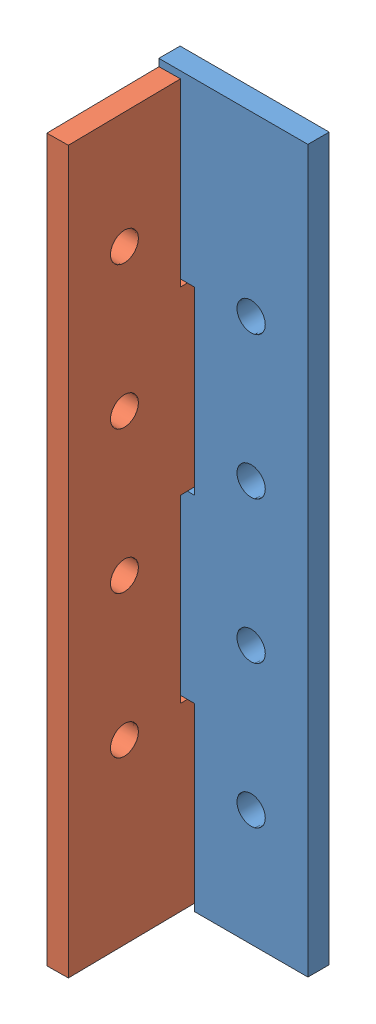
SolidWorks assembly Assem-hng.SLDASM, configuration Default (file format 9000). Lengths in mm.
Overall size (21 101.6 21.04).
2 component instances, 2 part files, 2 mates.
Components (placement in the parent):
- hng+-1: hng+.SLDPRT [Default] at (41.2599 54.728 74.8858) size (21 101.6 3)
- hng-1: hng.SLDPRT [Default] at (29.3959 54.728 86.9043) x (0.012939 0 0.999916) z (0.999916 0 -0.012939) size (21 101.6 3)
Mates (geometry in assembly coordinates):
- Coincident1: coincident aligned: cylinder of hng+-1 through (30.7599 60.128 76.3858) axis (0 1 0) radius 1; circle of hng-1
- Coincident2: coincident anti-aligned: plane of hng+-1 through (28.2599 54.728 77.8858) normal (0 1 0); plane of hng-1 through (32.2275 54.728 73.8666) normal (0 -1 0)
